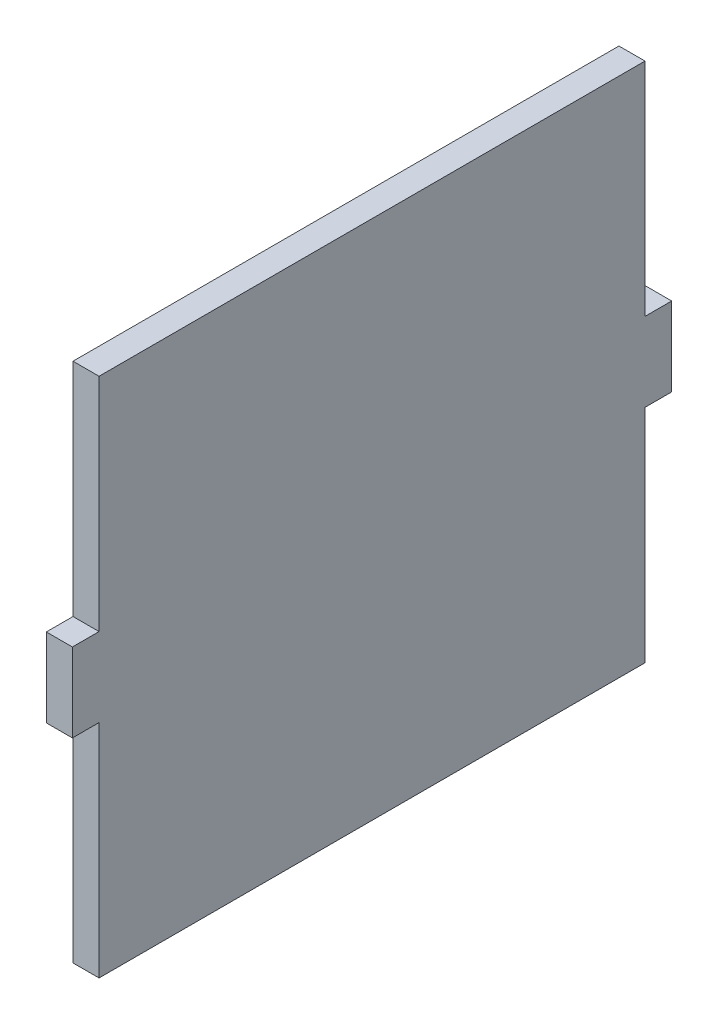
from build123d import *

# Parameters (mm, degrees)
BOSS_EXTRUDE1_DEPTH = 10


with BuildPart() as part:
    # Sketch1 → Boss-Extrude1 (new body)
    with BuildSketch(Plane(origin=(0, 0, 0), x_dir=(0, 0, -1), z_dir=(1, 0, 0))):
        Polygon((-80.337211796, 53.319129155), (129.182788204, 53.319129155), (129.182788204, -31.540870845), (139.422788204, -31.540870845), (139.422788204, -61.780870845), (129.182788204, -61.780870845), (129.182788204, -146.680870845), (-80.337211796, -146.680870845), (-80.337211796, -61.780870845), (-90.577211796, -61.780870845), (-90.577211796, -31.540870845), (-80.337211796, -31.540870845), align=None)
    extrude(amount=BOSS_EXTRUDE1_DEPTH)


solid = part.part
